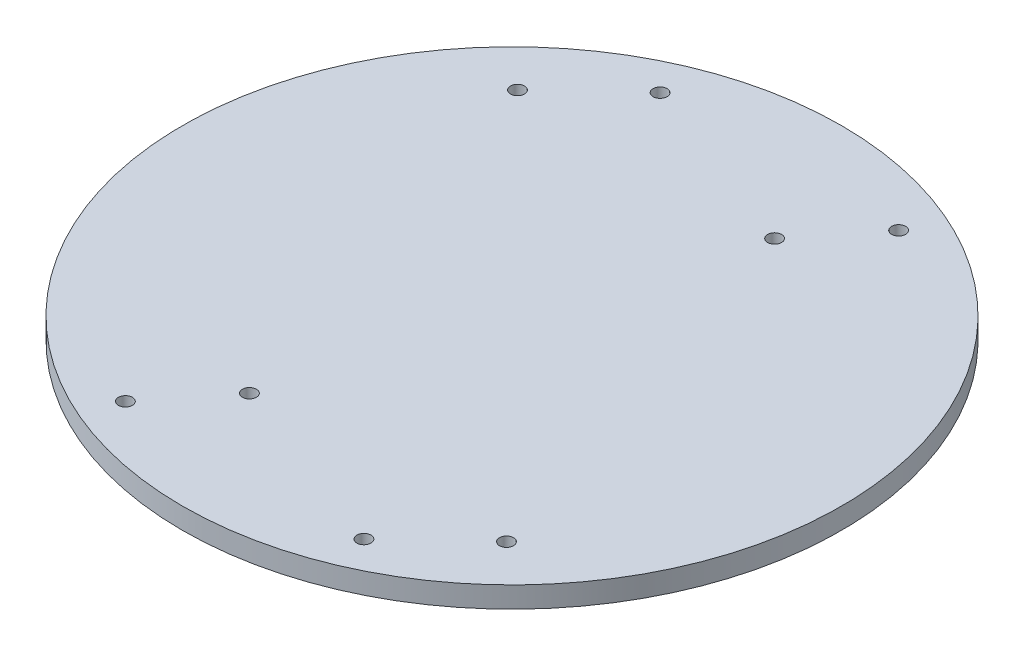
from build123d import *

# Parameters (mm, degrees)
SKETCH1_R           = 47
BASE_DEPTH          = 1.5
SKETCH6_R           = 1
HOLES_PATTERN_DEPTH = 67.535704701


with BuildPart() as part:
    # Sketch1 → Base (new, symmetric)
    with BuildSketch(Plane(origin=(0, 0, 0), x_dir=(1, 0, 0), z_dir=(0, 1, 0))):
        with Locations(Location((0, 0, 0), (0, 0, 270))):
            Circle(SKETCH1_R)
    extrude(amount=BASE_DEPTH, both=True)

    # Sketch6 → Holes Pattern (cut, through all)
    with BuildSketch(Plane(origin=(0, 1.5, 0), x_dir=(1, 0, 0), z_dir=(0, 1, 0))):
        with Locations(Location((27.5, -28.284271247, 0), (0, 0, 270))):
            Circle(SKETCH6_R)
        with Locations(Location((9.166666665, 28.284271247, 0), (0, 0, 270))):
            Circle(SKETCH6_R)
        with Locations(Location((-9.166666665, -28.284271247, 0), (0, 0, 270))):
            Circle(SKETCH6_R)
        with Locations(Location((-27.5, 28.284271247, 0), (0, 0, 270))):
            Circle(SKETCH6_R)
        with Locations(Location((17.009259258, -38.128042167, 0), (0, 0, 270))):
            Circle(SKETCH6_R)
        with Locations(Location((17.009259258, 38.128042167, 0), (0, 0, 90))):
            Circle(SKETCH6_R)
        with Locations(Location((-17.009259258, 38.128042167, 0), (0, 0, 270))):
            Circle(SKETCH6_R)
        with Locations(Location((-17.009259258, -38.128042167, 0), (0, 0, 90))):
            Circle(SKETCH6_R)
    extrude(amount=-HOLES_PATTERN_DEPTH, mode=Mode.SUBTRACT)


solid = part.part
